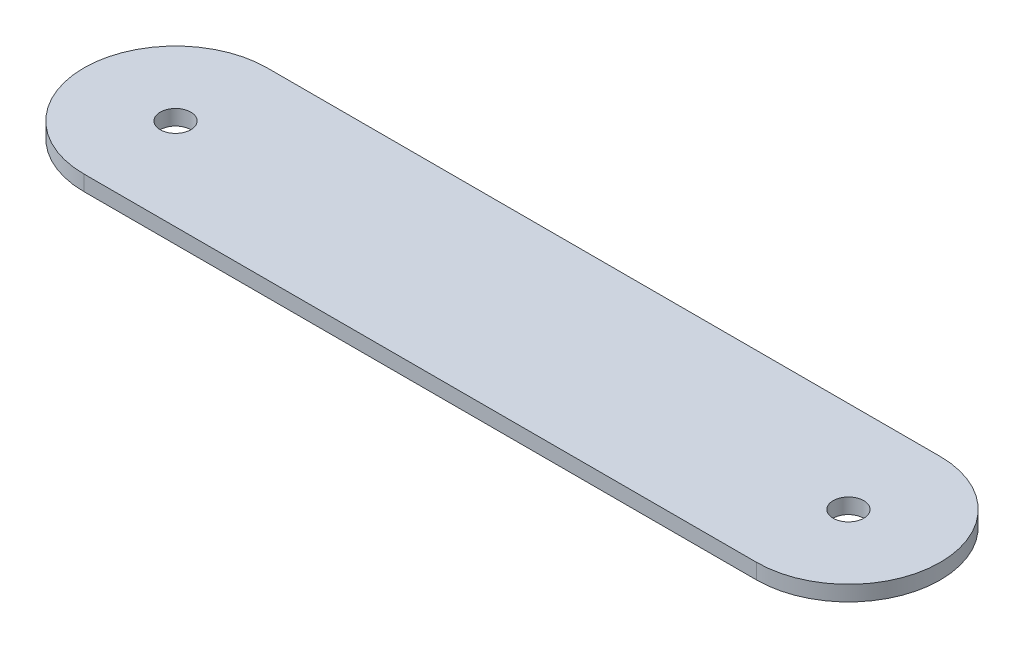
ISO-10303-21;
HEADER;
FILE_DESCRIPTION(('STEP AP214'),'2;1');
FILE_NAME('part.step','',(''),(''),'','','');
FILE_SCHEMA(('AUTOMOTIVE_DESIGN { 1 0 10303 214 1 1 1 1 }'));
ENDSEC;
DATA;
#1=APPLICATION_CONTEXT('core data for automotive mechanical design processes');
#2=APPLICATION_PROTOCOL_DEFINITION('international standard','automotive_design',2000,#1);
#3=PRODUCT_CONTEXT('',#1,'mechanical');
#4=PRODUCT('Part','Part','',(#3));
#5=PRODUCT_RELATED_PRODUCT_CATEGORY('part','',(#4));
#6=PRODUCT_DEFINITION_FORMATION('','',#4);
#7=PRODUCT_DEFINITION_CONTEXT('part definition',#1,'design');
#8=PRODUCT_DEFINITION('design','',#6,#7);
#9=PRODUCT_DEFINITION_SHAPE('','',#8);
#10=(LENGTH_UNIT() NAMED_UNIT(*) SI_UNIT(.MILLI.,.METRE.));
#11=(NAMED_UNIT(*) PLANE_ANGLE_UNIT() SI_UNIT($,.RADIAN.));
#12=(NAMED_UNIT(*) SI_UNIT($,.STERADIAN.) SOLID_ANGLE_UNIT());
#13=UNCERTAINTY_MEASURE_WITH_UNIT(LENGTH_MEASURE(1.E-05),#10,'distance_accuracy_value','');
#14=(GEOMETRIC_REPRESENTATION_CONTEXT(3) GLOBAL_UNCERTAINTY_ASSIGNED_CONTEXT((#13)) GLOBAL_UNIT_ASSIGNED_CONTEXT((#10,
#11,#12)) REPRESENTATION_CONTEXT('',''));
#15=CARTESIAN_POINT('',(0.,0.,0.));
#16=DIRECTION('',(0.,0.,1.));
#17=DIRECTION('',(1.,0.,0.));
#18=AXIS2_PLACEMENT_3D('',#15,#16,#17);
#19=CARTESIAN_POINT('',(-22.,1.,0.));
#20=DIRECTION('',(0.,1.,0.));
#21=DIRECTION('',(0.,0.,1.));
#22=AXIS2_PLACEMENT_3D('',#19,#20,#21);
#23=PLANE('',#22);
#24=CARTESIAN_POINT('',(-22.,1.,0.));
#25=DIRECTION('',(0.,1.,0.));
#26=DIRECTION('',(0.,0.,1.));
#27=AXIS2_PLACEMENT_3D('',#24,#25,#26);
#28=CIRCLE('',#27,1.);
#29=CARTESIAN_POINT('',(-22.,1.,1.));
#30=VERTEX_POINT('',#29);
#31=EDGE_CURVE('E106',#30,#30,#28,.T.);
#32=ORIENTED_EDGE('',*,*,#31,.F.);
#33=EDGE_LOOP('',(#32));
#34=FACE_BOUND('',#33,.T.);
#35=CARTESIAN_POINT('',(-22.,1.,0.));
#36=DIRECTION('',(0.,1.,0.));
#37=DIRECTION('',(0.,0.,1.));
#38=AXIS2_PLACEMENT_3D('',#35,#36,#37);
#39=CIRCLE('',#38,5.99999999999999);
#40=CARTESIAN_POINT('',(-22.,1.,-5.99999999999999));
#41=VERTEX_POINT('',#40);
#42=CARTESIAN_POINT('',(-22.,1.,5.99999999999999));
#43=VERTEX_POINT('',#42);
#44=EDGE_CURVE('E91',#41,#43,#39,.T.);
#45=ORIENTED_EDGE('',*,*,#44,.T.);
#46=DIRECTION('',(1.,0.,0.));
#47=VECTOR('',#46,1.);
#48=CARTESIAN_POINT('',(-22.,1.,5.99999999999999));
#49=LINE('',#48,#47);
#50=CARTESIAN_POINT('',(22.,1.,6.));
#51=VERTEX_POINT('',#50);
#52=EDGE_CURVE('E86',#43,#51,#49,.T.);
#53=ORIENTED_EDGE('',*,*,#52,.T.);
#54=CARTESIAN_POINT('',(22.,1.,0.));
#55=DIRECTION('',(0.,1.,0.));
#56=DIRECTION('',(0.,0.,1.));
#57=AXIS2_PLACEMENT_3D('',#54,#55,#56);
#58=CIRCLE('',#57,5.99999999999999);
#59=CARTESIAN_POINT('',(22.,1.,-5.99999999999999));
#60=VERTEX_POINT('',#59);
#61=EDGE_CURVE('E89',#51,#60,#58,.T.);
#62=ORIENTED_EDGE('',*,*,#61,.T.);
#63=DIRECTION('',(-1.,0.,0.));
#64=VECTOR('',#63,1.);
#65=CARTESIAN_POINT('',(-22.,1.,-5.99999999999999));
#66=LINE('',#65,#64);
#67=EDGE_CURVE('E56',#60,#41,#66,.T.);
#68=ORIENTED_EDGE('',*,*,#67,.T.);
#69=EDGE_LOOP('',(#45,#53,#62,#68));
#70=FACE_BOUND('',#69,.T.);
#71=CARTESIAN_POINT('',(22.,1.,0.));
#72=DIRECTION('',(0.,1.,0.));
#73=DIRECTION('',(0.,0.,1.));
#74=AXIS2_PLACEMENT_3D('',#71,#72,#73);
#75=CIRCLE('',#74,1.);
#76=CARTESIAN_POINT('',(22.,1.,1.));
#77=VERTEX_POINT('',#76);
#78=EDGE_CURVE('E121',#77,#77,#75,.T.);
#79=ORIENTED_EDGE('',*,*,#78,.F.);
#80=EDGE_LOOP('',(#79));
#81=FACE_BOUND('',#80,.T.);
#82=ADVANCED_FACE('F39',(#34,#70,#81),#23,.T.);
#83=CARTESIAN_POINT('',(-22.,0.,0.));
#84=DIRECTION('',(0.,1.,0.));
#85=DIRECTION('',(0.,0.,1.));
#86=AXIS2_PLACEMENT_3D('',#83,#84,#85);
#87=PLANE('',#86);
#88=CARTESIAN_POINT('',(-22.,0.,0.));
#89=DIRECTION('',(0.,1.,0.));
#90=DIRECTION('',(0.,0.,1.));
#91=AXIS2_PLACEMENT_3D('',#88,#89,#90);
#92=CIRCLE('',#91,5.99999999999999);
#93=CARTESIAN_POINT('',(-22.,0.,-5.99999999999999));
#94=VERTEX_POINT('',#93);
#95=CARTESIAN_POINT('',(-22.,0.,5.99999999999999));
#96=VERTEX_POINT('',#95);
#97=EDGE_CURVE('E103',#94,#96,#92,.T.);
#98=ORIENTED_EDGE('',*,*,#97,.F.);
#99=DIRECTION('',(-1.,0.,0.));
#100=VECTOR('',#99,1.);
#101=CARTESIAN_POINT('',(-22.,0.,-5.99999999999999));
#102=LINE('',#101,#100);
#103=CARTESIAN_POINT('',(22.,0.,-5.99999999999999));
#104=VERTEX_POINT('',#103);
#105=EDGE_CURVE('E79',#104,#94,#102,.T.);
#106=ORIENTED_EDGE('',*,*,#105,.F.);
#107=CARTESIAN_POINT('',(22.,0.,0.));
#108=DIRECTION('',(0.,1.,0.));
#109=DIRECTION('',(0.,0.,1.));
#110=AXIS2_PLACEMENT_3D('',#107,#108,#109);
#111=CIRCLE('',#110,5.99999999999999);
#112=CARTESIAN_POINT('',(22.,0.,6.));
#113=VERTEX_POINT('',#112);
#114=EDGE_CURVE('E73',#113,#104,#111,.T.);
#115=ORIENTED_EDGE('',*,*,#114,.F.);
#116=DIRECTION('',(1.,0.,0.));
#117=VECTOR('',#116,1.);
#118=CARTESIAN_POINT('',(-22.,0.,5.99999999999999));
#119=LINE('',#118,#117);
#120=EDGE_CURVE('E95',#96,#113,#119,.T.);
#121=ORIENTED_EDGE('',*,*,#120,.F.);
#122=EDGE_LOOP('',(#98,#106,#115,#121));
#123=FACE_BOUND('',#122,.T.);
#124=CARTESIAN_POINT('',(-22.,0.,0.));
#125=DIRECTION('',(0.,1.,0.));
#126=DIRECTION('',(0.,0.,1.));
#127=AXIS2_PLACEMENT_3D('',#124,#125,#126);
#128=CIRCLE('',#127,1.);
#129=CARTESIAN_POINT('',(-22.,0.,1.));
#130=VERTEX_POINT('',#129);
#131=EDGE_CURVE('E118',#130,#130,#128,.T.);
#132=ORIENTED_EDGE('',*,*,#131,.T.);
#133=EDGE_LOOP('',(#132));
#134=FACE_BOUND('',#133,.T.);
#135=CARTESIAN_POINT('',(22.,0.,0.));
#136=DIRECTION('',(0.,1.,0.));
#137=DIRECTION('',(0.,0.,1.));
#138=AXIS2_PLACEMENT_3D('',#135,#136,#137);
#139=CIRCLE('',#138,1.);
#140=CARTESIAN_POINT('',(22.,0.,1.));
#141=VERTEX_POINT('',#140);
#142=EDGE_CURVE('E124',#141,#141,#139,.T.);
#143=ORIENTED_EDGE('',*,*,#142,.T.);
#144=EDGE_LOOP('',(#143));
#145=FACE_BOUND('',#144,.T.);
#146=ADVANCED_FACE('F114',(#123,#134,#145),#87,.F.);
#147=CARTESIAN_POINT('',(-22.,1.,0.));
#148=DIRECTION('',(0.,-1.,0.));
#149=DIRECTION('',(0.,0.,-1.));
#150=AXIS2_PLACEMENT_3D('',#147,#148,#149);
#151=CYLINDRICAL_SURFACE('',#150,5.99999999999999);
#152=ORIENTED_EDGE('',*,*,#97,.T.);
#153=DIRECTION('',(0.,-1.,0.));
#154=VECTOR('',#153,1.);
#155=CARTESIAN_POINT('',(-22.,1.,5.99999999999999));
#156=LINE('',#155,#154);
#157=EDGE_CURVE('E11',#43,#96,#156,.T.);
#158=ORIENTED_EDGE('',*,*,#157,.F.);
#159=ORIENTED_EDGE('',*,*,#44,.F.);
#160=DIRECTION('',(0.,-1.,0.));
#161=VECTOR('',#160,1.);
#162=CARTESIAN_POINT('',(-22.,1.,-5.99999999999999));
#163=LINE('',#162,#161);
#164=EDGE_CURVE('E99',#41,#94,#163,.T.);
#165=ORIENTED_EDGE('',*,*,#164,.T.);
#166=EDGE_LOOP('',(#152,#158,#159,#165));
#167=FACE_BOUND('',#166,.T.);
#168=ADVANCED_FACE('F41',(#167),#151,.T.);
#169=CARTESIAN_POINT('',(-22.,1.,5.99999999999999));
#170=DIRECTION('',(0.,0.,-1.));
#171=DIRECTION('',(-1.,0.,0.));
#172=AXIS2_PLACEMENT_3D('',#169,#170,#171);
#173=PLANE('',#172);
#174=ORIENTED_EDGE('',*,*,#120,.T.);
#175=DIRECTION('',(0.,-1.,0.));
#176=VECTOR('',#175,1.);
#177=CARTESIAN_POINT('',(22.,1.,6.));
#178=LINE('',#177,#176);
#179=EDGE_CURVE('E48',#51,#113,#178,.T.);
#180=ORIENTED_EDGE('',*,*,#179,.F.);
#181=ORIENTED_EDGE('',*,*,#52,.F.);
#182=ORIENTED_EDGE('',*,*,#157,.T.);
#183=EDGE_LOOP('',(#174,#180,#181,#182));
#184=FACE_BOUND('',#183,.T.);
#185=ADVANCED_FACE('F94',(#184),#173,.F.);
#186=CARTESIAN_POINT('',(22.,1.,0.));
#187=DIRECTION('',(0.,-1.,0.));
#188=DIRECTION('',(0.,0.,-1.));
#189=AXIS2_PLACEMENT_3D('',#186,#187,#188);
#190=CYLINDRICAL_SURFACE('',#189,5.99999999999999);
#191=ORIENTED_EDGE('',*,*,#114,.T.);
#192=DIRECTION('',(0.,-1.,0.));
#193=VECTOR('',#192,1.);
#194=CARTESIAN_POINT('',(22.,1.,-5.99999999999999));
#195=LINE('',#194,#193);
#196=EDGE_CURVE('E96',#60,#104,#195,.T.);
#197=ORIENTED_EDGE('',*,*,#196,.F.);
#198=ORIENTED_EDGE('',*,*,#61,.F.);
#199=ORIENTED_EDGE('',*,*,#179,.T.);
#200=EDGE_LOOP('',(#191,#197,#198,#199));
#201=FACE_BOUND('',#200,.T.);
#202=ADVANCED_FACE('F97',(#201),#190,.T.);
#203=CARTESIAN_POINT('',(-22.,1.,-5.99999999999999));
#204=DIRECTION('',(0.,0.,1.));
#205=DIRECTION('',(1.,0.,0.));
#206=AXIS2_PLACEMENT_3D('',#203,#204,#205);
#207=PLANE('',#206);
#208=ORIENTED_EDGE('',*,*,#105,.T.);
#209=ORIENTED_EDGE('',*,*,#164,.F.);
#210=ORIENTED_EDGE('',*,*,#67,.F.);
#211=ORIENTED_EDGE('',*,*,#196,.T.);
#212=EDGE_LOOP('',(#208,#209,#210,#211));
#213=FACE_BOUND('',#212,.T.);
#214=ADVANCED_FACE('F111',(#213),#207,.F.);
#215=CARTESIAN_POINT('',(-22.,1.,0.));
#216=DIRECTION('',(0.,-1.,0.));
#217=DIRECTION('',(0.,0.,-1.));
#218=AXIS2_PLACEMENT_3D('',#215,#216,#217);
#219=CYLINDRICAL_SURFACE('',#218,1.);
#220=ORIENTED_EDGE('',*,*,#31,.T.);
#221=EDGE_LOOP('',(#220));
#222=FACE_BOUND('',#221,.T.);
#223=ORIENTED_EDGE('',*,*,#131,.F.);
#224=EDGE_LOOP('',(#223));
#225=FACE_BOUND('',#224,.T.);
#226=ADVANCED_FACE('F141',(#222,#225),#219,.F.);
#227=CARTESIAN_POINT('',(22.,1.,0.));
#228=DIRECTION('',(0.,-1.,0.));
#229=DIRECTION('',(0.,0.,-1.));
#230=AXIS2_PLACEMENT_3D('',#227,#228,#229);
#231=CYLINDRICAL_SURFACE('',#230,1.);
#232=ORIENTED_EDGE('',*,*,#78,.T.);
#233=EDGE_LOOP('',(#232));
#234=FACE_BOUND('',#233,.T.);
#235=ORIENTED_EDGE('',*,*,#142,.F.);
#236=EDGE_LOOP('',(#235));
#237=FACE_BOUND('',#236,.T.);
#238=ADVANCED_FACE('F130',(#234,#237),#231,.F.);
#239=CLOSED_SHELL('',(#82,#146,#168,#185,#202,#214,#226,#238));
#240=MANIFOLD_SOLID_BREP('B2',#239);
#241=ADVANCED_BREP_SHAPE_REPRESENTATION('',(#18,#240),#14);
#242=SHAPE_DEFINITION_REPRESENTATION(#9,#241);
ENDSEC;
END-ISO-10303-21;
